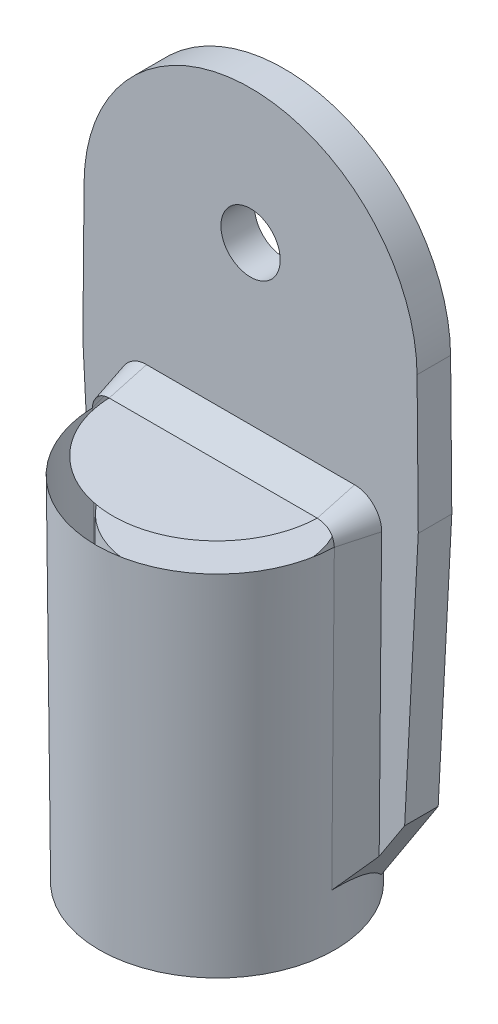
ISO-10303-21;
HEADER;
FILE_DESCRIPTION(('STEP AP214'),'2;1');
FILE_NAME('part.step','',(''),(''),'','','');
FILE_SCHEMA(('AUTOMOTIVE_DESIGN { 1 0 10303 214 1 1 1 1 }'));
ENDSEC;
DATA;
#1=APPLICATION_CONTEXT('core data for automotive mechanical design processes');
#2=APPLICATION_PROTOCOL_DEFINITION('international standard','automotive_design',2000,#1);
#3=PRODUCT_CONTEXT('',#1,'mechanical');
#4=PRODUCT('Part','Part','',(#3));
#5=PRODUCT_RELATED_PRODUCT_CATEGORY('part','',(#4));
#6=PRODUCT_DEFINITION_FORMATION('','',#4);
#7=PRODUCT_DEFINITION_CONTEXT('part definition',#1,'design');
#8=PRODUCT_DEFINITION('design','',#6,#7);
#9=PRODUCT_DEFINITION_SHAPE('','',#8);
#10=(LENGTH_UNIT() NAMED_UNIT(*) SI_UNIT(.MILLI.,.METRE.));
#11=(NAMED_UNIT(*) PLANE_ANGLE_UNIT() SI_UNIT($,.RADIAN.));
#12=(NAMED_UNIT(*) SI_UNIT($,.STERADIAN.) SOLID_ANGLE_UNIT());
#13=UNCERTAINTY_MEASURE_WITH_UNIT(LENGTH_MEASURE(1.E-05),#10,'distance_accuracy_value','');
#14=(GEOMETRIC_REPRESENTATION_CONTEXT(3) GLOBAL_UNCERTAINTY_ASSIGNED_CONTEXT((#13)) GLOBAL_UNIT_ASSIGNED_CONTEXT((#10,
#11,#12)) REPRESENTATION_CONTEXT('',''));
#15=CARTESIAN_POINT('',(0.,0.,0.));
#16=DIRECTION('',(0.,0.,1.));
#17=DIRECTION('',(1.,0.,0.));
#18=AXIS2_PLACEMENT_3D('',#15,#16,#17);
#19=CARTESIAN_POINT('',(12.6095898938,12.899972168,-2.54));
#20=DIRECTION('',(0.999961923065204,0.00872653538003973,0.));
#21=DIRECTION('',(0.00872653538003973,-0.999961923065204,0.));
#22=AXIS2_PLACEMENT_3D('',#19,#20,#21);
#23=PLANE('',#22);
#24=DIRECTION('',(0.,0.,1.));
#25=VECTOR('',#24,1.);
#26=CARTESIAN_POINT('',(12.7,2.54,-3.81));
#27=LINE('',#26,#25);
#28=CARTESIAN_POINT('',(12.6999999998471,2.53999991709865,-5.08));
#29=VERTEX_POINT('',#28);
#30=CARTESIAN_POINT('',(12.6999999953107,2.54000000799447,-2.54));
#31=VERTEX_POINT('',#30);
#32=EDGE_CURVE('E357',#29,#31,#27,.T.);
#33=ORIENTED_EDGE('',*,*,#32,.F.);
#34=DIRECTION('',(0.00872653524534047,-0.999961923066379,0.));
#35=VECTOR('',#34,1.);
#36=CARTESIAN_POINT('',(12.60958988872,12.8999721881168,-5.08));
#37=LINE('',#36,#35);
#38=CARTESIAN_POINT('',(12.6095898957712,12.8999721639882,-5.08));
#39=VERTEX_POINT('',#38);
#40=EDGE_CURVE('E360',#39,#29,#37,.T.);
#41=ORIENTED_EDGE('',*,*,#40,.F.);
#42=DIRECTION('',(0.,0.,-1.));
#43=VECTOR('',#42,1.);
#44=CARTESIAN_POINT('',(12.6095899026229,12.899972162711,-3.81));
#45=LINE('',#44,#43);
#46=CARTESIAN_POINT('',(12.6095898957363,12.8999721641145,-2.54));
#47=VERTEX_POINT('',#46);
#48=EDGE_CURVE('E359',#39,#47,#45,.F.);
#49=ORIENTED_EDGE('',*,*,#48,.T.);
#50=DIRECTION('',(-0.00872653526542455,0.999961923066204,0.));
#51=VECTOR('',#50,1.);
#52=CARTESIAN_POINT('',(12.6999999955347,2.53999980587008,-2.54));
#53=LINE('',#52,#51);
#54=EDGE_CURVE('E341',#31,#47,#53,.T.);
#55=ORIENTED_EDGE('',*,*,#54,.F.);
#56=EDGE_LOOP('',(#33,#41,#49,#55));
#57=FACE_BOUND('',#56,.T.);
#58=ADVANCED_FACE('F19',(#57),#23,.T.);
#59=CARTESIAN_POINT('',(0.,12.7899299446,-2.54));
#60=DIRECTION('',(0.,0.,-1.));
#61=DIRECTION('',(-1.,0.,0.));
#62=AXIS2_PLACEMENT_3D('',#59,#60,#61);
#63=CYLINDRICAL_SURFACE('',#62,12.6100700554);
#64=CARTESIAN_POINT('',(0.,12.7899299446,-2.54));
#65=DIRECTION('',(0.,0.,-1.));
#66=DIRECTION('',(-1.,0.,0.));
#67=AXIS2_PLACEMENT_3D('',#64,#65,#66);
#68=CIRCLE('',#67,12.6100700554);
#69=CARTESIAN_POINT('',(-12.6095898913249,12.899972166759,-2.54));
#70=VERTEX_POINT('',#69);
#71=EDGE_CURVE('E339',#47,#70,#68,.F.);
#72=ORIENTED_EDGE('',*,*,#71,.F.);
#73=ORIENTED_EDGE('',*,*,#48,.F.);
#74=CARTESIAN_POINT('',(0.,12.7899299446,-5.08));
#75=DIRECTION('',(0.,0.,-1.));
#76=DIRECTION('',(-1.,0.,0.));
#77=AXIS2_PLACEMENT_3D('',#74,#75,#76);
#78=CIRCLE('',#77,12.6100700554);
#79=CARTESIAN_POINT('',(-12.6095898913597,12.8999721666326,-5.08));
#80=VERTEX_POINT('',#79);
#81=EDGE_CURVE('E543',#80,#39,#78,.T.);
#82=ORIENTED_EDGE('',*,*,#81,.F.);
#83=DIRECTION('',(0.,0.,-1.));
#84=VECTOR('',#83,1.);
#85=CARTESIAN_POINT('',(-12.6095898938,12.899972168,-3.81));
#86=LINE('',#85,#84);
#87=EDGE_CURVE('E365',#70,#80,#86,.T.);
#88=ORIENTED_EDGE('',*,*,#87,.F.);
#89=EDGE_LOOP('',(#72,#73,#82,#88));
#90=FACE_BOUND('',#89,.T.);
#91=ADVANCED_FACE('F713',(#90),#63,.T.);
#92=CARTESIAN_POINT('',(-12.7,2.54,-2.54));
#93=DIRECTION('',(-0.999961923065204,0.00872653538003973,0.));
#94=DIRECTION('',(0.00872653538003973,0.999961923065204,0.));
#95=AXIS2_PLACEMENT_3D('',#92,#93,#94);
#96=PLANE('',#95);
#97=ORIENTED_EDGE('',*,*,#87,.T.);
#98=DIRECTION('',(0.00872653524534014,0.999961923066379,0.));
#99=VECTOR('',#98,1.);
#100=CARTESIAN_POINT('',(-12.6999999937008,2.5399999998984,-5.08));
#101=LINE('',#100,#99);
#102=CARTESIAN_POINT('',(-12.6999999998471,2.53999991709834,-5.08));
#103=VERTEX_POINT('',#102);
#104=EDGE_CURVE('E23',#103,#80,#101,.T.);
#105=ORIENTED_EDGE('',*,*,#104,.F.);
#106=DIRECTION('',(0.,0.,-1.));
#107=VECTOR('',#106,1.);
#108=CARTESIAN_POINT('',(-12.7,2.54,-3.81));
#109=LINE('',#108,#107);
#110=CARTESIAN_POINT('',(-12.6999999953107,2.54000000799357,-2.54));
#111=VERTEX_POINT('',#110);
#112=EDGE_CURVE('E130',#111,#103,#109,.T.);
#113=ORIENTED_EDGE('',*,*,#112,.F.);
#114=DIRECTION('',(-0.00872653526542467,-0.999961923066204,0.));
#115=VECTOR('',#114,1.);
#116=CARTESIAN_POINT('',(-12.60958988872,12.8999721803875,-2.54));
#117=LINE('',#116,#115);
#118=EDGE_CURVE('E336',#70,#111,#117,.T.);
#119=ORIENTED_EDGE('',*,*,#118,.F.);
#120=EDGE_LOOP('',(#97,#105,#113,#119));
#121=FACE_BOUND('',#120,.T.);
#122=ADVANCED_FACE('F567',(#121),#96,.T.);
#123=CARTESIAN_POINT('',(-7.8796909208,3.3144586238,-2.54));
#124=DIRECTION('',(0.,0.964540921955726,0.263933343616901));
#125=DIRECTION('',(0.,-0.263933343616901,0.964540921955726));
#126=AXIS2_PLACEMENT_3D('',#123,#124,#125);
#127=PLANE('',#126);
#128=DIRECTION('',(0.,-0.263933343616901,0.964540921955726));
#129=VECTOR('',#128,1.);
#130=CARTESIAN_POINT('',(7.8796909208,2.9272293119,-1.1248755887));
#131=LINE('',#130,#129);
#132=CARTESIAN_POINT('',(7.879690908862,3.31445863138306,-2.54));
#133=VERTEX_POINT('',#132);
#134=CARTESIAN_POINT('',(7.87981625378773,2.53999999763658,0.286804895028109));
#135=VERTEX_POINT('',#134);
#136=EDGE_CURVE('E220',#133,#135,#131,.T.);
#137=ORIENTED_EDGE('',*,*,#136,.F.);
#138=DIRECTION('',(1.,0.,0.));
#139=VECTOR('',#138,1.);
#140=CARTESIAN_POINT('',(0.,3.31445863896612,-2.54));
#141=LINE('',#140,#139);
#142=CARTESIAN_POINT('',(-7.87969101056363,3.3144586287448,-2.54000000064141));
#143=VERTEX_POINT('',#142);
#144=EDGE_CURVE('E215',#143,#133,#141,.T.);
#145=ORIENTED_EDGE('',*,*,#144,.F.);
#146=DIRECTION('',(-2.61728994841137E-08,0.263933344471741,-0.964540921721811));
#147=VECTOR('',#146,1.);
#148=CARTESIAN_POINT('',(-7.87969108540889,2.92722931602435,-1.12487559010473));
#149=LINE('',#148,#147);
#150=CARTESIAN_POINT('',(-7.87969093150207,2.53999999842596,0.290248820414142));
#151=VERTEX_POINT('',#150);
#152=EDGE_CURVE('E196',#151,#143,#149,.T.);
#153=ORIENTED_EDGE('',*,*,#152,.F.);
#154=DIRECTION('',(-1.,0.,0.));
#155=VECTOR('',#154,1.);
#156=CARTESIAN_POINT('',(0.000125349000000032,2.54,0.290248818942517));
#157=LINE('',#156,#155);
#158=EDGE_CURVE('E188',#151,#135,#157,.F.);
#159=ORIENTED_EDGE('',*,*,#158,.T.);
#160=EDGE_LOOP('',(#137,#145,#153,#159));
#161=FACE_BOUND('',#160,.T.);
#162=ADVANCED_FACE('F213',(#161),#127,.T.);
#163=CARTESIAN_POINT('',(0.,15.24,-5.08));
#164=DIRECTION('',(0.,0.,1.));
#165=DIRECTION('',(1.,0.,0.));
#166=AXIS2_PLACEMENT_3D('',#163,#164,#165);
#167=CYLINDRICAL_SURFACE('',#166,2.2479);
#168=CARTESIAN_POINT('',(0.,15.24,-2.54));
#169=DIRECTION('',(0.,0.,1.));
#170=DIRECTION('',(1.,0.,0.));
#171=AXIS2_PLACEMENT_3D('',#168,#169,#170);
#172=CIRCLE('',#171,2.2479);
#173=CARTESIAN_POINT('',(2.2479,15.24,-2.54));
#174=VERTEX_POINT('',#173);
#175=EDGE_CURVE('E332',#174,#174,#172,.F.);
#176=ORIENTED_EDGE('',*,*,#175,.F.);
#177=EDGE_LOOP('',(#176));
#178=FACE_BOUND('',#177,.T.);
#179=CARTESIAN_POINT('',(0.,15.24,-5.08));
#180=DIRECTION('',(0.,0.,1.));
#181=DIRECTION('',(1.,0.,0.));
#182=AXIS2_PLACEMENT_3D('',#179,#180,#181);
#183=CIRCLE('',#182,2.2479);
#184=CARTESIAN_POINT('',(2.2479,15.24,-5.08));
#185=VERTEX_POINT('',#184);
#186=EDGE_CURVE('E311',#185,#185,#183,.T.);
#187=ORIENTED_EDGE('',*,*,#186,.F.);
#188=EDGE_LOOP('',(#187));
#189=FACE_BOUND('',#188,.T.);
#190=ADVANCED_FACE('F560',(#178,#189),#167,.F.);
#191=CARTESIAN_POINT('',(12.7,2.54,-2.54));
#192=DIRECTION('',(0.99862953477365,-0.0523359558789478,0.));
#193=DIRECTION('',(-0.0523359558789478,-0.99862953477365,0.));
#194=AXIS2_PLACEMENT_3D('',#191,#192,#193);
#195=PLANE('',#194);
#196=DIRECTION('',(-0.0523359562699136,-0.99862953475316,0.));
#197=VECTOR('',#196,1.);
#198=CARTESIAN_POINT('',(12.7000000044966,2.54000000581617,-5.08));
#199=LINE('',#198,#197);
#200=CARTESIAN_POINT('',(11.6678511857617,-17.1545727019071,-5.08));
#201=VERTEX_POINT('',#200);
#202=EDGE_CURVE('E416',#29,#201,#199,.T.);
#203=ORIENTED_EDGE('',*,*,#202,.F.);
#204=ORIENTED_EDGE('',*,*,#32,.T.);
#205=DIRECTION('',(0.0523359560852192,0.99862953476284,0.));
#206=VECTOR('',#205,1.);
#207=CARTESIAN_POINT('',(11.6678511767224,-17.1545727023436,-2.54));
#208=LINE('',#207,#206);
#209=CARTESIAN_POINT('',(11.6678511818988,-17.154572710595,-2.5400000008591));
#210=VERTEX_POINT('',#209);
#211=EDGE_CURVE('E309',#210,#31,#208,.T.);
#212=ORIENTED_EDGE('',*,*,#211,.F.);
#213=DIRECTION('',(0.,0.,-1.));
#214=VECTOR('',#213,1.);
#215=CARTESIAN_POINT('',(11.667851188,-17.1545727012,-2.390382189));
#216=LINE('',#215,#214);
#217=EDGE_CURVE('E425',#210,#201,#216,.T.);
#218=ORIENTED_EDGE('',*,*,#217,.T.);
#219=EDGE_LOOP('',(#203,#204,#212,#218));
#220=FACE_BOUND('',#219,.T.);
#221=ADVANCED_FACE('F390',(#220),#195,.T.);
#222=CARTESIAN_POINT('',(-6.1029031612,2.54,-5.08));
#223=DIRECTION('',(0.,1.,0.));
#224=DIRECTION('',(1.,0.,0.));
#225=AXIS2_PLACEMENT_3D('',#222,#223,#224);
#226=PLANE('',#225);
#227=DIRECTION('',(-1.,0.,0.));
#228=VECTOR('',#227,1.);
#229=CARTESIAN_POINT('',(0.,2.5399999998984,-5.08));
#230=LINE('',#229,#228);
#231=CARTESIAN_POINT('',(6.03053672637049,2.53999999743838,-5.07999999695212));
#232=VERTEX_POINT('',#231);
#233=CARTESIAN_POINT('',(-6.03053672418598,2.53999999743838,-5.08000000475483));
#234=VERTEX_POINT('',#233);
#235=EDGE_CURVE('E518',#232,#234,#230,.T.);
#236=ORIENTED_EDGE('',*,*,#235,.F.);
#237=CARTESIAN_POINT('',(-6.61090408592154,2.53999999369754,-4.29764125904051));
#238=CARTESIAN_POINT('',(-3.16299721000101,2.53999999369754,-9.60143009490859));
#239=CARTESIAN_POINT('',(3.16299979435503,2.53999999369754,-9.60142924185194));
#240=CARTESIAN_POINT('',(6.6109052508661,2.53999999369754,-4.29763945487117));
#241=(BOUNDED_CURVE() B_SPLINE_CURVE(3,(#237,#238,#239,#240),.UNSPECIFIED.,.F.,
.F.) B_SPLINE_CURVE_WITH_KNOTS((4,4),(0.,1.),
.UNSPECIFIED.) CURVE() GEOMETRIC_REPRESENTATION_ITEM() RATIONAL_B_SPLINE_CURVE((0.956328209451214,
0.666265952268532,0.666265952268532,0.956328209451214)) REPRESENTATION_ITEM(''));
#242=EDGE_CURVE('E142',#234,#232,#241,.T.);
#243=ORIENTED_EDGE('',*,*,#242,.F.);
#244=EDGE_LOOP('',(#236,#243));
#245=FACE_BOUND('',#244,.T.);
#246=ADVANCED_FACE('F379',(#245),#226,.T.);
#247=CARTESIAN_POINT('',(-11.667851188,-17.1545727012,-2.54));
#248=DIRECTION('',(-0.99862953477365,-0.0523359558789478,0.));
#249=DIRECTION('',(-0.0523359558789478,0.99862953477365,0.));
#250=AXIS2_PLACEMENT_3D('',#247,#248,#249);
#251=PLANE('',#250);
#252=DIRECTION('',(0.0523359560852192,-0.99862953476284,0.));
#253=VECTOR('',#252,1.);
#254=CARTESIAN_POINT('',(-12.6999999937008,2.54000001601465,-2.54));
#255=LINE('',#254,#253);
#256=CARTESIAN_POINT('',(-11.6678511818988,-17.154572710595,-2.5400000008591));
#257=VERTEX_POINT('',#256);
#258=EDGE_CURVE('E331',#111,#257,#255,.T.);
#259=ORIENTED_EDGE('',*,*,#258,.F.);
#260=ORIENTED_EDGE('',*,*,#112,.T.);
#261=DIRECTION('',(-0.0523359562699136,0.99862953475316,0.));
#262=VECTOR('',#261,1.);
#263=CARTESIAN_POINT('',(-11.6678511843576,-17.154572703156,-5.08));
#264=LINE('',#263,#262);
#265=CARTESIAN_POINT('',(-11.6678511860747,-17.1545727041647,-5.08));
#266=VERTEX_POINT('',#265);
#267=EDGE_CURVE('E516',#266,#103,#264,.T.);
#268=ORIENTED_EDGE('',*,*,#267,.F.);
#269=DIRECTION('',(0.,0.,1.));
#270=VECTOR('',#269,1.);
#271=CARTESIAN_POINT('',(-11.667851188,-17.1545727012,-2.390382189));
#272=LINE('',#271,#270);
#273=EDGE_CURVE('E449',#266,#257,#272,.T.);
#274=ORIENTED_EDGE('',*,*,#273,.T.);
#275=EDGE_LOOP('',(#259,#260,#268,#274));
#276=FACE_BOUND('',#275,.T.);
#277=ADVANCED_FACE('F389',(#276),#251,.T.);
#278=CARTESIAN_POINT('',(-7.9742486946,2.54,7.930644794));
#279=DIRECTION('',(0.,1.,0.));
#280=DIRECTION('',(1.,0.,0.));
#281=AXIS2_PLACEMENT_3D('',#278,#279,#280);
#282=PLANE('',#281);
#283=CARTESIAN_POINT('',(7.88458564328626,2.53999999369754,0.0841565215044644));
#284=CARTESIAN_POINT('',(7.71979966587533,2.53999999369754,15.5228781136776));
#285=CARTESIAN_POINT('',(-7.71980131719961,2.53999999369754,15.5228772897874));
#286=CARTESIAN_POINT('',(-7.88458566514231,2.53999999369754,0.0841556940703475));
#287=(BOUNDED_CURVE() B_SPLINE_CURVE(3,(#283,#284,#285,#286),.UNSPECIFIED.,.F.,
.F.) B_SPLINE_CURVE_WITH_KNOTS((4,4),(0.,1.),
.UNSPECIFIED.) CURVE() GEOMETRIC_REPRESENTATION_ITEM() RATIONAL_B_SPLINE_CURVE((0.956328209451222,
0.325580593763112,0.325580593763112,0.956328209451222)) REPRESENTATION_ITEM(''));
#288=EDGE_CURVE('E191',#135,#151,#287,.T.);
#289=ORIENTED_EDGE('',*,*,#288,.F.);
#290=ORIENTED_EDGE('',*,*,#158,.F.);
#291=EDGE_LOOP('',(#289,#290));
#292=FACE_BOUND('',#291,.T.);
#293=ADVANCED_FACE('F190',(#292),#282,.T.);
#294=CARTESIAN_POINT('',(-9.9251724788,1.2521589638,-2.54));
#295=CARTESIAN_POINT('',(-9.9621071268,2.355642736,-2.54));
#296=CARTESIAN_POINT('',(-8.9780306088,3.3419866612,-2.54));
#297=CARTESIAN_POINT('',(-7.8796909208,3.3144586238,-2.54));
#298=CARTESIAN_POINT('',(-9.1510742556,1.2589172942,0.2676113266));
#299=CARTESIAN_POINT('',(-9.1740156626,1.9443918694,0.2674700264));
#300=CARTESIAN_POINT('',(-8.562523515,2.557100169,0.2750487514));
#301=CARTESIAN_POINT('',(-7.8796909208,2.54,0.2902488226));
#302=CARTESIAN_POINT('',(-9.14126049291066,1.25900297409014,0.303205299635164));
#303=CARTESIAN_POINT('',(-9.16402449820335,1.93917816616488,0.303062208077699));
#304=CARTESIAN_POINT('',(-8.55725585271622,2.54714963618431,0.310737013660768));
#305=CARTESIAN_POINT('',(-7.8796909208,2.53018166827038,0.326129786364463));
#306=B_SPLINE_SURFACE_WITH_KNOTS('',1,3,((#294,#295,#296,#297),(#298,#299,#300,#301),(#302,#303,
#304,#305)),.UNSPECIFIED.,.F.,.F.,.F.,(2,1,2),(4,4),(0.,1.,1.01267767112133),(0.,
0.00321247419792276),.UNSPECIFIED.);
#307=CARTESIAN_POINT('',(-9.92517248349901,1.25215910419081,-2.54));
#308=CARTESIAN_POINT('',(-9.92682129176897,1.30128076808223,-2.54));
#309=CARTESIAN_POINT('',(-9.92644564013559,1.35044730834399,-2.54));
#310=CARTESIAN_POINT('',(-9.92171191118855,1.44856797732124,-2.54));
#311=CARTESIAN_POINT('',(-9.91735553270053,1.49752218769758,-2.54));
#312=CARTESIAN_POINT('',(-9.89846766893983,1.64326581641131,-2.54));
#313=CARTESIAN_POINT('',(-9.87813009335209,1.73935489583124,-2.54));
#314=CARTESIAN_POINT('',(-9.82151359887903,1.93265896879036,-2.54));
#315=CARTESIAN_POINT('',(-9.78438578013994,2.02962136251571,-2.54));
#316=CARTESIAN_POINT('',(-9.69575172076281,2.21682989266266,-2.54));
#317=CARTESIAN_POINT('',(-9.64422831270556,2.30706784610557,-2.54));
#318=CARTESIAN_POINT('',(-9.52308960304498,2.48711692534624,-2.54));
#319=CARTESIAN_POINT('',(-9.45222883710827,2.57609040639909,-2.54));
#320=CARTESIAN_POINT('',(-9.29742540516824,2.7418923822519,-2.54));
#321=CARTESIAN_POINT('',(-9.21347472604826,2.81871337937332,-2.54));
#322=CARTESIAN_POINT('',(-9.02848853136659,2.9628284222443,-2.54));
#323=CARTESIAN_POINT('',(-8.92668583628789,3.02914151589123,-2.54));
#324=CARTESIAN_POINT('',(-8.71304466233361,3.14283846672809,-2.54));
#325=CARTESIAN_POINT('',(-8.60122226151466,3.19025200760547,-2.54));
#326=CARTESIAN_POINT('',(-8.43728722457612,3.24234221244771,-2.54));
#327=CARTESIAN_POINT('',(-8.38787738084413,3.25590539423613,-2.54));
#328=CARTESIAN_POINT('',(-8.28811425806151,3.27897544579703,-2.54));
#329=CARTESIAN_POINT('',(-8.23776119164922,3.28848321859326,-2.54));
#330=CARTESIAN_POINT('',(-8.13626299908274,3.3032988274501,-2.54));
#331=CARTESIAN_POINT('',(-8.08511573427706,3.30859200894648,-2.54));
#332=CARTESIAN_POINT('',(-7.9825270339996,3.314822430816,-2.54));
#333=CARTESIAN_POINT('',(-7.93108544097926,3.31575706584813,-2.54));
#334=CARTESIAN_POINT('',(-7.87969095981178,3.31445862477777,-2.54));
#335=B_SPLINE_CURVE_WITH_KNOTS('',3,(#307,#308,#309,#310,#311,#312,#313,#314,#315,#316,#317,
#318,#319,#320,#321,#322,#323,#324,#325,#326,#327,#328,#329,#330,#331,#332,#333,#334),
.UNSPECIFIED.,.F.,.F.,(4,2,2,2,2,2,2,2,2,2,2,2,2,4),(0.,0.147363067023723,0.29466327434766,
0.588021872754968,0.898238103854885,1.20882587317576,1.54861211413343,1.88860718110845,
2.25134411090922,2.61350905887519,2.76708991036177,2.92063654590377,3.07471477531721,
3.22888509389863),.UNSPECIFIED.);
#336=CARTESIAN_POINT('',(-9.92517282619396,1.25215919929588,-2.54000008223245));
#337=VERTEX_POINT('',#336);
#338=EDGE_CURVE('E324',#337,#143,#335,.T.);
#339=DIRECTION('',(-0.265795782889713,-0.00232055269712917,-0.964026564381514));
#340=VECTOR('',#339,1.);
#341=CARTESIAN_POINT('',(-9.53808466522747,1.25553880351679,-1.13605395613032));
#342=LINE('',#341,#340);
#343=CARTESIAN_POINT('',(-9.15102349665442,1.25891732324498,0.269332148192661));
#344=VERTEX_POINT('',#343);
#345=EDGE_CURVE('E223',#344,#337,#342,.T.);
#346=CARTESIAN_POINT('',(-7.87969092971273,2.53999999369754,0.290248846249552));
#347=CARTESIAN_POINT('',(-7.91413910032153,2.54000542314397,0.292654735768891));
#348=CARTESIAN_POINT('',(-7.94862865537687,2.53859325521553,0.294334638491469));
#349=CARTESIAN_POINT('',(-8.01739205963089,2.53296792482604,0.29641998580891));
#350=CARTESIAN_POINT('',(-8.05166605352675,2.52875690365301,0.296826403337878));
#351=CARTESIAN_POINT('',(-8.11967298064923,2.51758118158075,0.296545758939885));
#352=CARTESIAN_POINT('',(-8.15340700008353,2.51062300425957,0.295861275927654));
#353=CARTESIAN_POINT('',(-8.22017531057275,2.49401752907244,0.293685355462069));
#354=CARTESIAN_POINT('',(-8.25320947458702,2.48436974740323,0.292193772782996));
#355=CARTESIAN_POINT('',(-8.35080322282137,2.45153343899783,0.286986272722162));
#356=CARTESIAN_POINT('',(-8.41404938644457,2.42441954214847,0.282533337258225));
#357=CARTESIAN_POINT('',(-8.53536785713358,2.36037496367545,0.274100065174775));
#358=CARTESIAN_POINT('',(-8.59343940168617,2.32344283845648,0.270119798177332));
#359=CARTESIAN_POINT('',(-8.70534468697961,2.23877009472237,0.264233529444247));
#360=CARTESIAN_POINT('',(-8.75888084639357,2.1906264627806,0.26242616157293));
#361=CARTESIAN_POINT('',(-8.85702432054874,2.08593354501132,0.261800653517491));
#362=CARTESIAN_POINT('',(-8.9016298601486,2.02938259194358,0.262983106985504));
#363=CARTESIAN_POINT('',(-8.97935866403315,1.91146696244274,0.26725671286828));
#364=CARTESIAN_POINT('',(-9.01279219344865,1.85030317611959,0.2702881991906));
#365=CARTESIAN_POINT('',(-9.06920473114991,1.72331870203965,0.276009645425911));
#366=CARTESIAN_POINT('',(-9.0921917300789,1.65750161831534,0.278699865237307));
#367=CARTESIAN_POINT('',(-9.11671632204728,1.56328844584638,0.280228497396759));
#368=CARTESIAN_POINT('',(-9.12286056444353,1.53605004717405,0.280408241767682));
#369=CARTESIAN_POINT('',(-9.13336179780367,1.48123359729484,0.280076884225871));
#370=CARTESIAN_POINT('',(-9.13771918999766,1.45365562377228,0.279565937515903));
#371=CARTESIAN_POINT('',(-9.14463364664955,1.39826783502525,0.277701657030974));
#372=CARTESIAN_POINT('',(-9.14718841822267,1.3704577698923,0.276347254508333));
#373=CARTESIAN_POINT('',(-9.15048967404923,1.31477676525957,0.272707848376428));
#374=CARTESIAN_POINT('',(-9.15123519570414,1.28690580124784,0.270422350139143));
#375=CARTESIAN_POINT('',(-9.15107523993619,1.25908746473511,0.267628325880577));
#376=B_SPLINE_CURVE_WITH_KNOTS('',3,(#346,#347,#348,#349,#350,#351,#352,#353,#354,#355,#356,
#357,#358,#359,#360,#361,#362,#363,#364,#365,#366,#367,#368,#369,#370,#371,#372,#373,#374,#375),
.UNSPECIFIED.,.F.,.F.,(4,2,2,2,2,2,2,2,2,2,2,2,2,2,4),(0.,0.103545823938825,0.207012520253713,
0.310234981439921,0.413476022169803,0.619371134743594,0.825296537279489,1.04025380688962,
1.25525376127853,1.46365814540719,1.67190284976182,1.75562230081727,1.83932294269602,
1.92312985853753,2.00698135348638),.UNSPECIFIED.);
#377=EDGE_CURVE('E205',#151,#344,#376,.T.);
#378=ORIENTED_EDGE('',*,*,#152,.T.);
#379=ORIENTED_EDGE('',*,*,#338,.F.);
#380=ORIENTED_EDGE('',*,*,#345,.F.);
#381=ORIENTED_EDGE('',*,*,#377,.F.);
#382=EDGE_LOOP('',(#378,#379,#380,#381));
#383=FACE_BOUND('',#382,.T.);
#384=ADVANCED_FACE('F222',(#383),#306,.T.);
#385=CARTESIAN_POINT('',(7.84625571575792,3.31362710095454,-2.54));
#386=CARTESIAN_POINT('',(7.85740078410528,3.31390427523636,-2.54));
#387=CARTESIAN_POINT('',(7.86854585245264,3.31418144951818,-2.54));
#388=CARTESIAN_POINT('',(7.8796909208,3.3144586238,-2.54));
#389=CARTESIAN_POINT('',(8.9831630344,3.341901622,-2.54));
#390=CARTESIAN_POINT('',(9.9621834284,2.3504675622,-2.54));
#391=CARTESIAN_POINT('',(9.9251724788,1.2521589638,-2.54));
#392=CARTESIAN_POINT('',(9.924802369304,1.241175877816,-2.54));
#393=CARTESIAN_POINT('',(9.924432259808,1.230192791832,-2.54));
#394=CARTESIAN_POINT('',(9.924062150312,1.219209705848,-2.54));
#395=CARTESIAN_POINT('',(7.85890442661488,2.5394834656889,0.29071123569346));
#396=CARTESIAN_POINT('',(7.86583325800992,2.5396556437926,0.29055709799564));
#397=CARTESIAN_POINT('',(7.87276208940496,2.5398278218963,0.29040296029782));
#398=CARTESIAN_POINT('',(7.8796909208,2.54,0.2902488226));
#399=CARTESIAN_POINT('',(8.5657138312,2.557047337,0.2749876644));
#400=CARTESIAN_POINT('',(9.1740627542,1.941177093,0.2674764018));
#401=CARTESIAN_POINT('',(9.1510742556,1.2589172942,0.2676113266));
#402=CARTESIAN_POINT('',(9.150844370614,1.252094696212,0.267612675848));
#403=CARTESIAN_POINT('',(9.150614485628,1.245272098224,0.267614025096));
#404=CARTESIAN_POINT('',(9.150384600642,1.238449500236,0.267615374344));
#405=CARTESIAN_POINT('',(7.85907459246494,2.52906874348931,0.32879340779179));
#406=CARTESIAN_POINT('',(7.86594670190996,2.52923950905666,0.328637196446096));
#407=CARTESIAN_POINT('',(7.87281881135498,2.529410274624,0.328480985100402));
#408=CARTESIAN_POINT('',(7.8796909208,2.52958104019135,0.328324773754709));
#409=CARTESIAN_POINT('',(8.56009779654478,2.54648852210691,0.312858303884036));
#410=CARTESIAN_POINT('',(9.16345999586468,1.93567081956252,0.305245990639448));
#411=CARTESIAN_POINT('',(9.14066014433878,1.25900821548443,0.305382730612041));
#412=CARTESIAN_POINT('',(9.14043214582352,1.25224158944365,0.305384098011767));
#413=CARTESIAN_POINT('',(9.14020414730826,1.24547496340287,0.305385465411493));
#414=CARTESIAN_POINT('',(9.139976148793,1.23870833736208,0.305386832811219));
#415=B_SPLINE_SURFACE_WITH_KNOTS('',1,3,((#385,#386,#387,#388,#389,#390,#391,#392,#393,#394),
(#395,#396,#397,#398,#399,#400,#401,#402,#403,#404),(#405,#406,#407,#408,#409,#410,#411,#412,
#413,#414)),.UNSPECIFIED.,.F.,.F.,.F.,(2,1,2),(4,3,3,4),(0.,1.,1.0134532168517),
(-3.24459861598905E-05,0.,0.00321247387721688,0.00324459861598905),.UNSPECIFIED.);
#416=DIRECTION('',(-0.265795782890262,0.00232055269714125,0.964026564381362));
#417=VECTOR('',#416,1.);
#418=CARTESIAN_POINT('',(9.534252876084,1.255571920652,-1.122156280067));
#419=LINE('',#418,#417);
#420=CARTESIAN_POINT('',(9.92517236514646,1.25215894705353,-2.5399999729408));
#421=VERTEX_POINT('',#420);
#422=CARTESIAN_POINT('',(9.15107439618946,1.25891729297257,0.267610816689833));
#423=VERTEX_POINT('',#422);
#424=EDGE_CURVE('E226',#421,#423,#419,.T.);
#425=CARTESIAN_POINT('',(7.87969090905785,3.31445862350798,-2.54));
#426=CARTESIAN_POINT('',(7.94093714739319,3.316002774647,-2.54));
#427=CARTESIAN_POINT('',(8.0022462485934,3.31437768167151,-2.54));
#428=CARTESIAN_POINT('',(8.12435108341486,3.30497856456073,-2.54));
#429=CARTESIAN_POINT('',(8.18514714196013,3.29720878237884,-2.54));
#430=CARTESIAN_POINT('',(8.30527263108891,3.27578285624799,-2.54));
#431=CARTESIAN_POINT('',(8.36460912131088,3.262166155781,-2.54));
#432=CARTESIAN_POINT('',(8.48170330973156,3.22935833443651,-2.54));
#433=CARTESIAN_POINT('',(8.53946096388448,3.21016705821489,-2.54));
#434=CARTESIAN_POINT('',(8.69381146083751,3.15082096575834,-2.54));
#435=CARTESIAN_POINT('',(8.78846863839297,3.10551446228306,-2.54));
#436=CARTESIAN_POINT('',(8.96990867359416,3.00114933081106,-2.54));
#437=CARTESIAN_POINT('',(9.05668238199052,2.94207500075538,-2.54));
#438=CARTESIAN_POINT('',(9.22950424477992,2.80491047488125,-2.54));
#439=CARTESIAN_POINT('',(9.31447746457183,2.7254606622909,-2.54));
#440=CARTESIAN_POINT('',(9.47065831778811,2.55394445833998,-2.54));
#441=CARTESIAN_POINT('',(9.54185765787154,2.46187052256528,-2.54));
#442=CARTESIAN_POINT('',(9.67102345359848,2.26294622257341,-2.54));
#443=CARTESIAN_POINT('',(9.72826503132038,2.15562231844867,-2.54));
#444=CARTESIAN_POINT('',(9.82237592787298,1.93249675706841,-2.54));
#445=CARTESIAN_POINT('',(9.85928658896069,1.81671285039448,-2.54));
#446=CARTESIAN_POINT('',(9.90052384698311,1.62533985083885,-2.54));
#447=CARTESIAN_POINT('',(9.91190490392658,1.55122154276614,-2.54));
#448=CARTESIAN_POINT('',(9.92551185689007,1.40209348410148,-2.54));
#449=CARTESIAN_POINT('',(9.92773020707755,1.32708304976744,-2.54));
#450=CARTESIAN_POINT('',(9.92517247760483,1.25215892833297,-2.54));
#451=B_SPLINE_CURVE_WITH_KNOTS('',3,(#425,#426,#427,#428,#429,#430,#431,#432,#433,#434,#435,
#436,#437,#438,#439,#440,#441,#442,#443,#444,#445,#446,#447,#448,#449,#450),.UNSPECIFIED.,.F.,
.F.,(4,2,2,2,2,2,2,2,2,2,2,2,4),(0.,0.183691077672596,0.367255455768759,0.549600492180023,
0.73195061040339,1.04540927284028,1.35922719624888,1.70668584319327,2.05435305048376,
2.41740293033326,2.77971180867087,3.00414939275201,3.22877177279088),.UNSPECIFIED.);
#452=EDGE_CURVE('E301',#133,#421,#451,.T.);
#453=CARTESIAN_POINT('',(9.15107427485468,1.25891727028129,0.267611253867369));
#454=CARTESIAN_POINT('',(9.15127892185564,1.29340130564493,0.27112029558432));
#455=CARTESIAN_POINT('',(9.15008902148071,1.32796711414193,0.273801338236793));
#456=CARTESIAN_POINT('',(9.14492941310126,1.39694428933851,0.277727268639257));
#457=CARTESIAN_POINT('',(9.14096207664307,1.43135576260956,0.278973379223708));
#458=CARTESIAN_POINT('',(9.1302686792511,1.49969276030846,0.28025314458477));
#459=CARTESIAN_POINT('',(9.12354854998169,1.5336191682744,0.280289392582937));
#460=CARTESIAN_POINT('',(9.10739437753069,1.60080485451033,0.279496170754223));
#461=CARTESIAN_POINT('',(9.0979597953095,1.63406399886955,0.278666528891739));
#462=CARTESIAN_POINT('',(9.06569963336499,1.7323610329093,0.275436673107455));
#463=CARTESIAN_POINT('',(9.03888689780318,1.79611431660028,0.272295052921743));
#464=CARTESIAN_POINT('',(8.97525680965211,1.91840012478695,0.266697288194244));
#465=CARTESIAN_POINT('',(8.93844125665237,1.97693358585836,0.264241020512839));
#466=CARTESIAN_POINT('',(8.85437302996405,2.08904589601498,0.261657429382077));
#467=CARTESIAN_POINT('',(8.80682228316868,2.14240433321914,0.261607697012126));
#468=CARTESIAN_POINT('',(8.7034492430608,2.2403495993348,0.264413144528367));
#469=CARTESIAN_POINT('',(8.64762229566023,2.28493145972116,0.267269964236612));
#470=CARTESIAN_POINT('',(8.53072862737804,2.36319618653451,0.274660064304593));
#471=CARTESIAN_POINT('',(8.46980675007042,2.39710020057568,0.27915448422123));
#472=CARTESIAN_POINT('',(8.34328402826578,2.45454203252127,0.287664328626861));
#473=CARTESIAN_POINT('',(8.27768787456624,2.47809007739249,0.291680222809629));
#474=CARTESIAN_POINT('',(8.15670537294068,2.51066247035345,0.296158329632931));
#475=CARTESIAN_POINT('',(8.10186519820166,2.5216380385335,0.29716624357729));
#476=CARTESIAN_POINT('',(8.01888938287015,2.53264333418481,0.296390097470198));
#477=CARTESIAN_POINT('',(7.991085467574,2.53540210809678,0.295748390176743));
#478=CARTESIAN_POINT('',(7.93537443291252,2.53908270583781,0.293634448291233));
#479=CARTESIAN_POINT('',(7.90746726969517,2.54000362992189,0.29216180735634));
#480=CARTESIAN_POINT('',(7.87958170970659,2.53999998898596,0.290241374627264));
#481=B_SPLINE_CURVE_WITH_KNOTS('',3,(#453,#454,#455,#456,#457,#458,#459,#460,#461,#462,#463,
#464,#465,#466,#467,#468,#469,#470,#471,#472,#473,#474,#475,#476,#477,#478,#479,#480),
.UNSPECIFIED.,.F.,.F.,(4,2,2,2,2,2,2,2,2,2,2,2,2,4),(0.,0.103934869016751,0.207781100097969,
0.311404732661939,0.415048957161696,0.621750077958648,0.828414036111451,1.04173692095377,
1.25518022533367,1.46385727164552,1.67232777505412,1.83957296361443,1.92335069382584,
2.00716942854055),.UNSPECIFIED.);
#482=EDGE_CURVE('E208',#423,#135,#481,.T.);
#483=ORIENTED_EDGE('',*,*,#424,.F.);
#484=ORIENTED_EDGE('',*,*,#452,.F.);
#485=ORIENTED_EDGE('',*,*,#136,.T.);
#486=ORIENTED_EDGE('',*,*,#482,.F.);
#487=EDGE_LOOP('',(#483,#484,#485,#486));
#488=FACE_BOUND('',#487,.T.);
#489=ADVANCED_FACE('F283',(#488),#415,.T.);
#490=CARTESIAN_POINT('',(-12.8524,25.6731527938,-2.54));
#491=DIRECTION('',(0.,0.,1.));
#492=DIRECTION('',(0.,-1.,0.));
#493=AXIS2_PLACEMENT_3D('',#490,#491,#492);
#494=PLANE('',#493);
#495=ORIENTED_EDGE('',*,*,#175,.T.);
#496=EDGE_LOOP('',(#495));
#497=FACE_BOUND('',#496,.T.);
#498=ORIENTED_EDGE('',*,*,#338,.T.);
#499=ORIENTED_EDGE('',*,*,#144,.T.);
#500=ORIENTED_EDGE('',*,*,#452,.T.);
#501=DIRECTION('',(0.00873026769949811,0.99996189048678,0.));
#502=VECTOR('',#501,1.);
#503=CARTESIAN_POINT('',(9.825956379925,-10.111970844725,-2.54));
#504=LINE('',#503,#502);
#505=CARTESIAN_POINT('',(9.7385318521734,-20.1254643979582,-2.54000000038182));
#506=VERTEX_POINT('',#505);
#507=EDGE_CURVE('E434',#506,#421,#504,.T.);
#508=ORIENTED_EDGE('',*,*,#507,.F.);
#509=DIRECTION('',(0.544639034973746,0.838670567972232,0.));
#510=VECTOR('',#509,1.);
#511=CARTESIAN_POINT('',(9.4969467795,-20.49747234,-2.54000000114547));
#512=LINE('',#511,#510);
#513=EDGE_CURVE('E175',#506,#210,#512,.T.);
#514=ORIENTED_EDGE('',*,*,#513,.T.);
#515=ORIENTED_EDGE('',*,*,#211,.T.);
#516=ORIENTED_EDGE('',*,*,#54,.T.);
#517=ORIENTED_EDGE('',*,*,#71,.T.);
#518=ORIENTED_EDGE('',*,*,#118,.T.);
#519=ORIENTED_EDGE('',*,*,#258,.T.);
#520=DIRECTION('',(0.544639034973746,-0.838670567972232,0.));
#521=VECTOR('',#520,1.);
#522=CARTESIAN_POINT('',(-9.4969467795,-20.49747234,-2.54000000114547));
#523=LINE('',#522,#521);
#524=CARTESIAN_POINT('',(-9.73853134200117,-20.1254648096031,-2.54000000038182));
#525=VERTEX_POINT('',#524);
#526=EDGE_CURVE('E463',#257,#525,#523,.T.);
#527=ORIENTED_EDGE('',*,*,#526,.T.);
#528=DIRECTION('',(0.00873041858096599,-0.999961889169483,0.));
#529=VECTOR('',#528,1.);
#530=CARTESIAN_POINT('',(-9.82694854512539,-9.9983295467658,-2.54));
#531=LINE('',#530,#529);
#532=EDGE_CURVE('E744',#337,#525,#531,.T.);
#533=ORIENTED_EDGE('',*,*,#532,.F.);
#534=EDGE_LOOP('',(#498,#499,#500,#508,#514,#515,#516,#517,#518,#519,#527,#533));
#535=FACE_BOUND('',#534,.T.);
#536=ADVANCED_FACE('F288',(#497,#535),#494,.T.);
#537=CARTESIAN_POINT('',(7.326042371,-23.8403719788,0.299235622));
#538=DIRECTION('',(-0.838670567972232,0.544639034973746,0.));
#539=DIRECTION('',(0.544639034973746,0.838670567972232,0.));
#540=AXIS2_PLACEMENT_3D('',#537,#538,#539);
#541=PLANE('',#540);
#542=CARTESIAN_POINT('',(8.9538382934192,-21.3337856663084,0.267152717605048));
#543=CARTESIAN_POINT('',(8.9865338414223,-21.283438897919,0.150188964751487));
#544=CARTESIAN_POINT('',(9.01922936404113,-21.2330921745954,0.0332251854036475));
#545=CARTESIAN_POINT('',(9.08462041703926,-21.1323987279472,-0.200702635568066));
#546=CARTESIAN_POINT('',(9.11731594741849,-21.0820520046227,-0.317666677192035));
#547=CARTESIAN_POINT('',(9.18270701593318,-20.9813585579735,-0.551595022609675));
#548=CARTESIAN_POINT('',(9.21540255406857,-20.931011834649,-0.668559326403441));
#549=CARTESIAN_POINT('',(9.28079363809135,-20.8303183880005,-0.902488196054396));
#550=CARTESIAN_POINT('',(9.31348918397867,-20.7799716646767,-1.01945276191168));
#551=CARTESIAN_POINT('',(9.3788802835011,-20.6792782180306,-1.25338215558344));
#552=CARTESIAN_POINT('',(9.41157583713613,-20.6289314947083,-1.37034698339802));
#553=CARTESIAN_POINT('',(9.47696695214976,-20.528238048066,-1.60427690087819));
#554=CARTESIAN_POINT('',(9.50966251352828,-20.4778913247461,-1.72124199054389));
#555=CARTESIAN_POINT('',(9.5750536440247,-20.3771978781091,-1.95517243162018));
#556=CARTESIAN_POINT('',(9.60774921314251,-20.3268511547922,-2.07213778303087));
#557=CARTESIAN_POINT('',(9.67314035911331,-20.226157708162,-2.30606874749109));
#558=CARTESIAN_POINT('',(9.7058359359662,-20.1758109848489,-2.42303436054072));
#559=CARTESIAN_POINT('',(9.73853148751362,-20.1254643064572,-2.54));
#560=B_SPLINE_CURVE_WITH_KNOTS('',3,(#542,#543,#544,#545,#546,#547,#548,#549,#550,#551,#552,
#553,#554,#555,#556,#557,#558,#559),.UNSPECIFIED.,.F.,.F.,(4,2,2,2,2,2,2,2,4),(0.,
0.394409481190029,0.788819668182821,1.18323056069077,1.57764215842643,1.97205446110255,
2.36646746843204,2.76088118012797,3.15529559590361),.UNSPECIFIED.);
#561=CARTESIAN_POINT('',(8.95383878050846,-21.3337851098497,0.267150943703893));
#562=VERTEX_POINT('',#561);
#563=EDGE_CURVE('E232',#562,#506,#560,.T.);
#564=ORIENTED_EDGE('',*,*,#563,.F.);
#565=CARTESIAN_POINT('',(8.9538382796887,-21.3337860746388,0.267152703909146));
#566=CARTESIAN_POINT('',(8.9541748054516,-21.333267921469,0.256025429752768));
#567=CARTESIAN_POINT('',(8.95449034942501,-21.3327820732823,0.244896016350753));
#568=CARTESIAN_POINT('',(8.95507935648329,-21.3318751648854,0.222636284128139));
#569=CARTESIAN_POINT('',(8.95535283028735,-21.3314540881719,0.21150596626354));
#570=CARTESIAN_POINT('',(8.95585769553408,-21.3306767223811,0.189244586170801));
#571=CARTESIAN_POINT('',(8.95608909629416,-21.3303204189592,0.178113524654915));
#572=CARTESIAN_POINT('',(8.95650981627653,-21.3296725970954,0.155850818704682));
#573=CARTESIAN_POINT('',(8.95669914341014,-21.3293810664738,0.144719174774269));
#574=CARTESIAN_POINT('',(8.95703571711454,-21.3288627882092,0.122455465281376));
#575=CARTESIAN_POINT('',(8.95718297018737,-21.3286360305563,0.111323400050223));
#576=CARTESIAN_POINT('',(8.95743539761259,-21.3282472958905,0.0890590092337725));
#577=CARTESIAN_POINT('',(8.95754057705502,-21.3280853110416,0.0779266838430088));
#578=CARTESIAN_POINT('',(8.95770885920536,-21.3278261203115,0.0556619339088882));
#579=CARTESIAN_POINT('',(8.95777196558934,-21.327728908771,0.044529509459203));
#580=CARTESIAN_POINT('',(8.95785610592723,-21.327599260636,0.022264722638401));
#581=CARTESIAN_POINT('',(8.95787714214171,-21.3275668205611,0.0111323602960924));
#582=CARTESIAN_POINT('',(8.95787714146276,-21.3275667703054,-2.29093952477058E-09));
#583=B_SPLINE_CURVE_WITH_KNOTS('',3,(#565,#566,#567,#568,#569,#570,#571,#572,#573,#574,#575,
#576,#577,#578,#579,#580,#581,#582),.UNSPECIFIED.,.F.,.F.,(4,2,2,2,2,2,2,2,4),(0.,
0.033433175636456,0.0668578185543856,0.100275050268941,0.133685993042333,0.167091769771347,
0.200493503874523,0.233892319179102,0.267289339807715),.UNSPECIFIED.);
#584=CARTESIAN_POINT('',(8.95787714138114,-21.327566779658,-2.98276107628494E-09));
#585=VERTEX_POINT('',#584);
#586=EDGE_CURVE('E43',#585,#562,#583,.F.);
#587=ORIENTED_EDGE('',*,*,#586,.F.);
#588=CARTESIAN_POINT('',(0.118781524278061,-34.9385804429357,0.));
#589=DIRECTION('',(-0.838670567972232,0.544639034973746,0.));
#590=DIRECTION('',(0.544639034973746,0.838670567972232,0.));
#591=AXIS2_PLACEMENT_3D('',#588,#589,#590);
#592=ELLIPSE('',#591,16.2292730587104,8.83829747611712);
#593=CARTESIAN_POINT('',(7.35193783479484,-23.8004964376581,-5.08));
#594=VERTEX_POINT('',#593);
#595=EDGE_CURVE('E236',#585,#594,#592,.T.);
#596=ORIENTED_EDGE('',*,*,#595,.T.);
#597=DIRECTION('',(-0.544639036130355,-0.838670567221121,0.));
#598=VECTOR('',#597,1.);
#599=CARTESIAN_POINT('',(11.6678511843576,-17.154572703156,-5.08));
#600=LINE('',#599,#598);
#601=EDGE_CURVE('E170',#201,#594,#600,.T.);
#602=ORIENTED_EDGE('',*,*,#601,.F.);
#603=ORIENTED_EDGE('',*,*,#217,.F.);
#604=ORIENTED_EDGE('',*,*,#513,.F.);
#605=EDGE_LOOP('',(#564,#587,#596,#602,#603,#604));
#606=FACE_BOUND('',#605,.T.);
#607=ADVANCED_FACE('F317',(#606),#541,.F.);
#608=CARTESIAN_POINT('',(6.504604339,2.5336552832,-4.2285350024));
#609=CARTESIAN_POINT('',(3.1121399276,2.5336552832,-9.447041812));
#610=CARTESIAN_POINT('',(-3.1121373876,2.5336552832,-9.4470426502));
#611=CARTESIAN_POINT('',(-6.504603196,2.5336552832,-4.2285367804));
#612=CARTESIAN_POINT('',(7.2332887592,2.6208586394,-4.7022406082));
#613=CARTESIAN_POINT('',(3.4607803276,2.6208586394,-10.505355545));
#614=CARTESIAN_POINT('',(-3.4607774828,2.6208586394,-10.5053564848));
#615=CARTESIAN_POINT('',(-7.2332874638,2.6208586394,-4.702242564));
#616=CARTESIAN_POINT('',(7.748869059,2.0005197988,-5.0374107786));
#617=CARTESIAN_POINT('',(3.7074606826,2.0005197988,-11.2541648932));
#618=CARTESIAN_POINT('',(-3.7074576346,2.0005197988,-11.2541659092));
#619=CARTESIAN_POINT('',(-7.7488676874,2.0005197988,-5.0374128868));
#620=CARTESIAN_POINT('',(7.6694006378,1.1321890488,-4.9857496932));
#621=CARTESIAN_POINT('',(3.6694388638,1.1321890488,-11.138747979));
#622=CARTESIAN_POINT('',(-3.6694358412,1.1321890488,-11.1387489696));
#623=CARTESIAN_POINT('',(-7.6693992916,1.1321890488,-4.9857517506));
#624=(BOUNDED_SURFACE() B_SPLINE_SURFACE(3,3,((#608,#609,#610,#611),(#612,#613,#614,#615),(#616,
#617,#618,#619),(#620,#621,#622,#623)),.UNSPECIFIED.,.F.,.F.,
.F.) B_SPLINE_SURFACE_WITH_KNOTS((4,4),(4,4),(0.,1.),(0.,1.),
.UNSPECIFIED.) GEOMETRIC_REPRESENTATION_ITEM() RATIONAL_B_SPLINE_SURFACE(((1.,0.696691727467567,
0.696691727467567,1.),(0.753064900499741,0.524654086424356,0.524654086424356,0.753064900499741),
(0.753064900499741,0.524654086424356,0.524654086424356,0.753064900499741),(1.,0.696691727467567,
0.696691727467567,1.))) REPRESENTATION_ITEM('') SURFACE());
#625=CARTESIAN_POINT('',(6.03053672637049,2.53999999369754,-5.08));
#626=CARTESIAN_POINT('',(6.13756389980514,2.54000393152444,-5.08000000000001));
#627=CARTESIAN_POINT('',(6.24493218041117,2.53207466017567,-5.08));
#628=CARTESIAN_POINT('',(6.45775631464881,2.49903325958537,-5.08));
#629=CARTESIAN_POINT('',(6.5631922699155,2.47379506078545,-5.07999999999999));
#630=CARTESIAN_POINT('',(6.74846072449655,2.41133070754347,-5.07999999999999));
#631=CARTESIAN_POINT('',(6.82935516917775,2.3772880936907,-5.08));
#632=CARTESIAN_POINT('',(6.98441371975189,2.29661864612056,-5.08));
#633=CARTESIAN_POINT('',(7.05859806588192,2.2500314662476,-5.08));
#634=CARTESIAN_POINT('',(7.1856829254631,2.15315008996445,-5.08));
#635=CARTESIAN_POINT('',(7.24006360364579,2.10480272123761,-5.08));
#636=CARTESIAN_POINT('',(7.34018029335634,1.99974248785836,-5.08));
#637=CARTESIAN_POINT('',(7.38591395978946,1.94302736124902,-5.08));
#638=CARTESIAN_POINT('',(7.4667911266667,1.82181678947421,-5.08));
#639=CARTESIAN_POINT('',(7.50185295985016,1.75726638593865,-5.08));
#640=CARTESIAN_POINT('',(7.55873675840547,1.6226092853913,-5.08));
#641=CARTESIAN_POINT('',(7.58058481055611,1.55251384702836,-5.08));
#642=CARTESIAN_POINT('',(7.60249648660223,1.44448302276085,-5.08));
#643=CARTESIAN_POINT('',(7.60798836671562,1.40758256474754,-5.08));
#644=CARTESIAN_POINT('',(7.61506587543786,1.33342916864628,-5.08));
#645=CARTESIAN_POINT('',(7.61665356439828,1.29617642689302,-5.08));
#646=CARTESIAN_POINT('',(7.6162573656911,1.25891729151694,-5.08));
#647=B_SPLINE_CURVE_WITH_KNOTS('',3,(#625,#626,#627,#628,#629,#630,#631,#632,#633,#634,#635,
#636,#637,#638,#639,#640,#641,#642,#643,#644,#645,#646),.UNSPECIFIED.,.F.,.F.,(4,2,2,2,2,2,2,2,
2,2,4),(0.,0.321343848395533,0.645053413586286,0.907337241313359,1.16880152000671,
1.38621606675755,1.60368949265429,1.8227875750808,2.04145168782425,2.15318963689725,
2.26486860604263),.UNSPECIFIED.);
#648=CARTESIAN_POINT('',(7.61625736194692,1.25891729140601,-5.08));
#649=VERTEX_POINT('',#648);
#650=EDGE_CURVE('E407',#232,#649,#647,.T.);
#651=CARTESIAN_POINT('',(0.,1.25891729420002,0.));
#652=DIRECTION('',(0.,1.,0.));
#653=DIRECTION('',(-1.,0.,0.));
#654=AXIS2_PLACEMENT_3D('',#651,#652,#653);
#655=CIRCLE('',#654,9.1549864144);
#656=CARTESIAN_POINT('',(-7.61625736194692,1.25891729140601,-5.08));
#657=VERTEX_POINT('',#656);
#658=EDGE_CURVE('E440',#649,#657,#655,.T.);
#659=CARTESIAN_POINT('',(-7.61625735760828,1.25891729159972,-5.08));
#660=CARTESIAN_POINT('',(-7.61658697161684,1.29011574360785,-5.08));
#661=CARTESIAN_POINT('',(-7.61552874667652,1.32131236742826,-5.08));
#662=CARTESIAN_POINT('',(-7.61066920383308,1.3834806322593,-5.08));
#663=CARTESIAN_POINT('',(-7.60686883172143,1.41445234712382,-5.08));
#664=CARTESIAN_POINT('',(-7.59145855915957,1.5063946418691,-5.08));
#665=CARTESIAN_POINT('',(-7.57584223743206,1.56673771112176,-5.08));
#666=CARTESIAN_POINT('',(-7.53473180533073,1.68383257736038,-5.08));
#667=CARTESIAN_POINT('',(-7.50924659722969,1.74058755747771,-5.08));
#668=CARTESIAN_POINT('',(-7.44956530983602,1.84934884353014,-5.08));
#669=CARTESIAN_POINT('',(-7.41536166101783,1.9013509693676,-5.08000000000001));
#670=CARTESIAN_POINT('',(-7.3376165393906,2.0022513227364,-5.08000000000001));
#671=CARTESIAN_POINT('',(-7.29367829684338,2.05084205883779,-5.08));
#672=CARTESIAN_POINT('',(-7.19925878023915,2.14114427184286,-5.08));
#673=CARTESIAN_POINT('',(-7.14877543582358,2.1828535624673,-5.08));
#674=CARTESIAN_POINT('',(-7.03458858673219,2.2650264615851,-5.08));
#675=CARTESIAN_POINT('',(-6.9700447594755,2.30431937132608,-5.08));
#676=CARTESIAN_POINT('',(-6.83602756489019,2.37357715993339,-5.08));
#677=CARTESIAN_POINT('',(-6.7665440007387,2.4035220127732,-5.08));
#678=CARTESIAN_POINT('',(-6.61059282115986,2.45920715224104,-5.08));
#679=CARTESIAN_POINT('',(-6.52343782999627,2.48301677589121,-5.08));
#680=CARTESIAN_POINT('',(-6.34679484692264,2.51834362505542,-5.08));
#681=CARTESIAN_POINT('',(-6.25730869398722,2.52987025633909,-5.08));
#682=CARTESIAN_POINT('',(-6.12188799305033,2.53855864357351,-5.08));
#683=CARTESIAN_POINT('',(-6.0761979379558,2.53999844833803,-5.08));
#684=CARTESIAN_POINT('',(-6.03053672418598,2.53999999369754,-5.08));
#685=B_SPLINE_CURVE_WITH_KNOTS('',3,(#659,#660,#661,#662,#663,#664,#665,#666,#667,#668,#669,
#670,#671,#672,#673,#674,#675,#676,#677,#678,#679,#680,#681,#682,#683,#684),.UNSPECIFIED.,.F.,
.F.,(4,2,2,2,2,2,2,2,2,2,2,2,4),(0.,0.0935379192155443,0.187043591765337,0.373033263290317,
0.558855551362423,0.744839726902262,0.940614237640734,1.1364508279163,1.36230261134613,
1.58863496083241,1.85870350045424,2.1285650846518,2.26559108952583),.UNSPECIFIED.);
#686=EDGE_CURVE('E409',#657,#234,#685,.T.);
#687=ORIENTED_EDGE('',*,*,#242,.T.);
#688=ORIENTED_EDGE('',*,*,#650,.T.);
#689=ORIENTED_EDGE('',*,*,#658,.T.);
#690=ORIENTED_EDGE('',*,*,#686,.T.);
#691=EDGE_LOOP('',(#687,#688,#689,#690));
#692=FACE_BOUND('',#691,.T.);
#693=ADVANCED_FACE('F290',(#692),#624,.T.);
#694=CARTESIAN_POINT('',(-12.7320883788,-23.9585394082,-5.08));
#695=DIRECTION('',(0.,0.,-1.));
#696=DIRECTION('',(0.,1.,0.));
#697=AXIS2_PLACEMENT_3D('',#694,#695,#696);
#698=PLANE('',#697);
#699=CARTESIAN_POINT('',(-7.60304781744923,-9.57191270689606E-09,-5.08));
#700=CARTESIAN_POINT('',(-7.47605067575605,-12.1000357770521,-5.08));
#701=CARTESIAN_POINT('',(-7.35193783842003,-23.8004964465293,-5.08));
#702=B_SPLINE_CURVE_WITH_KNOTS('',2,(#699,#700,#701),.UNSPECIFIED.,.F.,.F.,(3,3),(0.,1.),.UNSPECIFIED.);
#703=CARTESIAN_POINT('',(-7.6030478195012,1.34276493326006E-08,-5.08));
#704=VERTEX_POINT('',#703);
#705=CARTESIAN_POINT('',(-7.35193784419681,-23.8004964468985,-5.08));
#706=VERTEX_POINT('',#705);
#707=EDGE_CURVE('E443',#704,#706,#702,.T.);
#708=ORIENTED_EDGE('',*,*,#707,.T.);
#709=DIRECTION('',(-0.544639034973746,0.838670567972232,0.));
#710=VECTOR('',#709,1.);
#711=CARTESIAN_POINT('',(-9.4969467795,-20.49747234,-5.08));
#712=LINE('',#711,#710);
#713=EDGE_CURVE('E445',#706,#266,#712,.T.);
#714=ORIENTED_EDGE('',*,*,#713,.T.);
#715=ORIENTED_EDGE('',*,*,#267,.T.);
#716=ORIENTED_EDGE('',*,*,#104,.T.);
#717=ORIENTED_EDGE('',*,*,#81,.T.);
#718=ORIENTED_EDGE('',*,*,#40,.T.);
#719=ORIENTED_EDGE('',*,*,#202,.T.);
#720=ORIENTED_EDGE('',*,*,#601,.T.);
#721=CARTESIAN_POINT('',(7.35193783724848,-23.8004964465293,-5.08));
#722=CARTESIAN_POINT('',(7.47605067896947,-12.1000353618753,-5.08));
#723=CARTESIAN_POINT('',(7.60304781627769,-9.57191270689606E-09,-5.08));
#724=B_SPLINE_CURVE_WITH_KNOTS('',2,(#721,#722,#723),.UNSPECIFIED.,.F.,.F.,(3,3),(0.,1.),.UNSPECIFIED.);
#725=CARTESIAN_POINT('',(7.6030478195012,1.34276490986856E-08,-5.08));
#726=VERTEX_POINT('',#725);
#727=EDGE_CURVE('E444',#594,#726,#724,.T.);
#728=ORIENTED_EDGE('',*,*,#727,.T.);
#729=DIRECTION('',(0.0104922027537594,0.999944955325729,0.));
#730=VECTOR('',#729,1.);
#731=CARTESIAN_POINT('',(7.6030478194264,6.2991999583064E-09,-5.08));
#732=LINE('',#731,#730);
#733=EDGE_CURVE('E527',#726,#649,#732,.T.);
#734=ORIENTED_EDGE('',*,*,#733,.T.);
#735=ORIENTED_EDGE('',*,*,#650,.F.);
#736=ORIENTED_EDGE('',*,*,#235,.T.);
#737=ORIENTED_EDGE('',*,*,#686,.F.);
#738=DIRECTION('',(0.0104922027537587,-0.999944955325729,0.));
#739=VECTOR('',#738,1.);
#740=CARTESIAN_POINT('',(-7.6162573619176,1.258917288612,-5.08));
#741=LINE('',#740,#739);
#742=EDGE_CURVE('E526',#657,#704,#741,.T.);
#743=ORIENTED_EDGE('',*,*,#742,.T.);
#744=EDGE_LOOP('',(#708,#714,#715,#716,#717,#718,#719,#720,#728,#734,#735,#736,#737,#743));
#745=FACE_BOUND('',#744,.T.);
#746=ORIENTED_EDGE('',*,*,#186,.T.);
#747=EDGE_LOOP('',(#746));
#748=FACE_BOUND('',#747,.T.);
#749=ADVANCED_FACE('F558',(#745,#748),#698,.T.);
#750=CARTESIAN_POINT('',(-11.667851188,-17.1545727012,0.299235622));
#751=DIRECTION('',(0.838670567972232,0.544639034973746,0.));
#752=DIRECTION('',(0.544639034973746,-0.838670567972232,0.));
#753=AXIS2_PLACEMENT_3D('',#750,#751,#752);
#754=PLANE('',#753);
#755=ORIENTED_EDGE('',*,*,#273,.F.);
#756=ORIENTED_EDGE('',*,*,#713,.F.);
#757=CARTESIAN_POINT('',(-0.11878152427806,-34.9385804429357,0.));
#758=DIRECTION('',(0.838670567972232,0.544639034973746,0.));
#759=DIRECTION('',(-0.544639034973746,0.838670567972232,0.));
#760=AXIS2_PLACEMENT_3D('',#757,#758,#759);
#761=ELLIPSE('',#760,16.2292730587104,8.83829747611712);
#762=CARTESIAN_POINT('',(-8.95787714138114,-21.327566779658,-1.1454698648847E-09));
#763=VERTEX_POINT('',#762);
#764=EDGE_CURVE('E484',#706,#763,#761,.T.);
#765=ORIENTED_EDGE('',*,*,#764,.T.);
#766=CARTESIAN_POINT('',(-8.95787714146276,-21.3275667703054,-2.2909397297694E-09));
#767=CARTESIAN_POINT('',(-8.95787714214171,-21.3275668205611,0.0111323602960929));
#768=CARTESIAN_POINT('',(-8.95785610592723,-21.327599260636,0.0222647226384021));
#769=CARTESIAN_POINT('',(-8.95777196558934,-21.327728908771,0.0445295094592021));
#770=CARTESIAN_POINT('',(-8.95770885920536,-21.3278261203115,0.0556619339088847));
#771=CARTESIAN_POINT('',(-8.95754057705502,-21.3280853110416,0.0779266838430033));
#772=CARTESIAN_POINT('',(-8.95743539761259,-21.3282472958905,0.0890590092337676));
#773=CARTESIAN_POINT('',(-8.95718297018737,-21.3286360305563,0.111323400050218));
#774=CARTESIAN_POINT('',(-8.95703571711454,-21.3288627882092,0.12245546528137));
#775=CARTESIAN_POINT('',(-8.95669914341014,-21.3293810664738,0.144719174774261));
#776=CARTESIAN_POINT('',(-8.95650981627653,-21.3296725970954,0.155850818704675));
#777=CARTESIAN_POINT('',(-8.95608909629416,-21.3303204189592,0.178113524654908));
#778=CARTESIAN_POINT('',(-8.95585769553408,-21.3306767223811,0.189244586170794));
#779=CARTESIAN_POINT('',(-8.95535283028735,-21.3314540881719,0.211505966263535));
#780=CARTESIAN_POINT('',(-8.95507935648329,-21.3318751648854,0.222636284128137));
#781=CARTESIAN_POINT('',(-8.95449034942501,-21.3327820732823,0.244896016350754));
#782=CARTESIAN_POINT('',(-8.9541748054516,-21.333267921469,0.256025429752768));
#783=CARTESIAN_POINT('',(-8.9538382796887,-21.3337860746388,0.267152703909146));
#784=B_SPLINE_CURVE_WITH_KNOTS('',3,(#766,#767,#768,#769,#770,#771,#772,#773,#774,#775,#776,
#777,#778,#779,#780,#781,#782,#783),.UNSPECIFIED.,.F.,.F.,(4,2,2,2,2,2,2,2,4),(0.,
0.0333970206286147,0.0667958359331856,0.100197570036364,0.133603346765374,0.167014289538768,
0.200431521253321,0.233856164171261,0.267289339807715),.UNSPECIFIED.);
#785=CARTESIAN_POINT('',(-8.95383829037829,-21.333786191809,0.267152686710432));
#786=VERTEX_POINT('',#785);
#787=EDGE_CURVE('E450',#786,#763,#784,.F.);
#788=ORIENTED_EDGE('',*,*,#787,.F.);
#789=CARTESIAN_POINT('',(-9.73853148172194,-20.1254649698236,-2.54));
#790=CARTESIAN_POINT('',(-9.70583593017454,-20.1758116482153,-2.42303436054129));
#791=CARTESIAN_POINT('',(-9.67314035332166,-20.2261583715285,-2.30606874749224));
#792=CARTESIAN_POINT('',(-9.6077492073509,-20.3268518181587,-2.07213778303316));
#793=CARTESIAN_POINT('',(-9.5750536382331,-20.3771985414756,-1.95517243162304));
#794=CARTESIAN_POINT('',(-9.50966250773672,-20.4778919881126,-1.72124199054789));
#795=CARTESIAN_POINT('',(-9.47696694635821,-20.5282387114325,-1.60427690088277));
#796=CARTESIAN_POINT('',(-9.41157583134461,-20.6289321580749,-1.37034698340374));
#797=CARTESIAN_POINT('',(-9.37888027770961,-20.6792788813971,-1.25338215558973));
#798=CARTESIAN_POINT('',(-9.31348917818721,-20.7799723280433,-1.01945276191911));
#799=CARTESIAN_POINT('',(-9.2807936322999,-20.8303190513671,-0.902488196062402));
#800=CARTESIAN_POINT('',(-9.21540254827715,-20.9310124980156,-0.668559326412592));
#801=CARTESIAN_POINT('',(-9.18270701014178,-20.9813592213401,-0.551595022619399));
#802=CARTESIAN_POINT('',(-9.11731594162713,-21.0820526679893,-0.317666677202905));
#803=CARTESIAN_POINT('',(-9.08462041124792,-21.1323993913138,-0.200702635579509));
#804=CARTESIAN_POINT('',(-9.01922935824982,-21.2330928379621,0.0332251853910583));
#805=CARTESIAN_POINT('',(-8.98653383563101,-21.2834395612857,0.150188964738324));
#806=CARTESIAN_POINT('',(-8.95383828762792,-21.3337863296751,0.267152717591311));
#807=B_SPLINE_CURVE_WITH_KNOTS('',3,(#789,#790,#791,#792,#793,#794,#795,#796,#797,#798,#799,
#800,#801,#802,#803,#804,#805,#806),.UNSPECIFIED.,.F.,.F.,(4,2,2,2,2,2,2,2,4),(0.,
0.394414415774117,0.788828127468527,1.18324113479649,1.57765343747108,1.97206503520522,
2.36647592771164,2.7608861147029,3.1552955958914),.UNSPECIFIED.);
#808=EDGE_CURVE('E454',#525,#786,#807,.T.);
#809=ORIENTED_EDGE('',*,*,#808,.F.);
#810=ORIENTED_EDGE('',*,*,#526,.F.);
#811=EDGE_LOOP('',(#755,#756,#765,#788,#809,#810));
#812=FACE_BOUND('',#811,.T.);
#813=ADVANCED_FACE('F597',(#812),#754,.F.);
#814=CARTESIAN_POINT('',(-9.73448026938,-21.476168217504,-2.568071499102));
#815=CARTESIAN_POINT('',(-9.800625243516,-13.900081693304,-2.568073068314));
#816=CARTESIAN_POINT('',(-9.866769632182,-6.323995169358,-2.568074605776));
#817=CARTESIAN_POINT('',(-9.932913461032,1.252091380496,-2.568076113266));
#818=CARTESIAN_POINT('',(-9.9335748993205,1.32785224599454,-2.5680761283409));
#819=CARTESIAN_POINT('',(-9.934236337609,1.40361311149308,-2.5680761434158));
#820=CARTESIAN_POINT('',(-9.9348977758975,1.47937397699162,-2.5680761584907));
#821=CARTESIAN_POINT('',(-9.7267394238,-21.4761006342,-2.54));
#822=CARTESIAN_POINT('',(-9.7928843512,-13.90001411,-2.54));
#823=CARTESIAN_POINT('',(-9.8590286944,-6.3239275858,-2.54));
#824=CARTESIAN_POINT('',(-9.9251724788,1.2521589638,-2.54));
#825=CARTESIAN_POINT('',(-9.925833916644,1.327919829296,-2.54));
#826=CARTESIAN_POINT('',(-9.926495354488,1.403680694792,-2.54));
#827=CARTESIAN_POINT('',(-9.927156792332,1.479441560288,-2.54));
#828=CARTESIAN_POINT('',(-8.9526548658,-21.4693423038,0.2671499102));
#829=CARTESIAN_POINT('',(-9.0187951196,-13.8932557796,0.2673068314));
#830=CARTESIAN_POINT('',(-9.0849349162,-6.31716923,0.2674605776));
#831=CARTESIAN_POINT('',(-9.1510742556,1.2589172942,0.2676113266));
#832=CARTESIAN_POINT('',(-9.151735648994,1.334678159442,0.26761283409));
#833=CARTESIAN_POINT('',(-9.152397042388,1.410439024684,0.26761434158));
#834=CARTESIAN_POINT('',(-9.153058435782,1.486199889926,0.26761584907));
#835=CARTESIAN_POINT('',(-8.9448366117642,-21.469274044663,0.29550212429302));
#836=CARTESIAN_POINT('',(-9.01097681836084,-13.893187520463,0.29566063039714));
#837=CARTESIAN_POINT('',(-9.07711656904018,-6.31710097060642,0.29581592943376));
#838=CARTESIAN_POINT('',(-9.14325586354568,1.25898555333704,0.29596820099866));
#839=CARTESIAN_POINT('',(-9.14391725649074,1.33474641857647,0.295969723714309));
#840=CARTESIAN_POINT('',(-9.14457864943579,1.41050728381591,0.295971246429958));
#841=CARTESIAN_POINT('',(-9.14524004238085,1.48626814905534,0.295972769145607));
#842=B_SPLINE_SURFACE_WITH_KNOTS('',1,3,((#814,#815,#816,#817,#818,#819,#820),(#821,#822,#823,
#824,#825,#826,#827),(#828,#829,#830,#831,#832,#833,#834),(#835,#836,#837,#838,#839,#840,#841)),
.UNSPECIFIED.,.F.,.F.,.F.,(2,1,1,2),(4,3,4),(-0.01,0.,1.,1.0101),(-0.000722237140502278,
0.0220068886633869,0.0222341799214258),.UNSPECIFIED.);
#843=CARTESIAN_POINT('',(-8.95383827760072,-21.3337861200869,0.267152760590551));
#844=CARTESIAN_POINT('',(-8.97112862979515,-19.3532492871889,0.267193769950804));
#845=CARTESIAN_POINT('',(-8.98841895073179,-17.3727124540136,0.267234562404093));
#846=CARTESIAN_POINT('',(-9.02299953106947,-13.4116387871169,0.267315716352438));
#847=CARTESIAN_POINT('',(-9.04028979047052,-11.4311019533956,0.267356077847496));
#848=CARTESIAN_POINT('',(-9.0887448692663,-5.88073777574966,0.267468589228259));
#849=CARTESIAN_POINT('',(-9.11990962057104,-2.31091043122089,0.267540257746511));
#850=CARTESIAN_POINT('',(-9.15107427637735,1.25891691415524,0.267611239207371));
#851=B_SPLINE_CURVE_WITH_KNOTS('',3,(#843,#844,#845,#846,#847,#848,#849,#850),.UNSPECIFIED.,.F.,
.F.,(4,2,2,4),(0.,5.94183691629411,11.8836738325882,22.5935639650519),.UNSPECIFIED.);
#852=EDGE_CURVE('E478',#786,#344,#851,.T.);
#853=ORIENTED_EDGE('',*,*,#345,.T.);
#854=ORIENTED_EDGE('',*,*,#532,.T.);
#855=ORIENTED_EDGE('',*,*,#808,.T.);
#856=ORIENTED_EDGE('',*,*,#852,.T.);
#857=EDGE_LOOP('',(#853,#854,#855,#856));
#858=FACE_BOUND('',#857,.T.);
#859=ADVANCED_FACE('F258',(#858),#842,.T.);
#860=CARTESIAN_POINT('',(-7.7578044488,2.5336552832,0.0828025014));
#861=CARTESIAN_POINT('',(-7.5956697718,2.5336552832,15.2732751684));
#862=CARTESIAN_POINT('',(7.5956681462,2.5336552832,15.2732759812));
#863=CARTESIAN_POINT('',(7.7578044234,2.5336552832,0.0828033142));
#864=CARTESIAN_POINT('',(-8.626879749,2.6208586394,0.0920785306));
#865=CARTESIAN_POINT('',(-8.446581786,2.6208586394,16.9842781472));
#866=CARTESIAN_POINT('',(8.4465799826,2.6208586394,16.9842790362));
#867=CARTESIAN_POINT('',(8.626879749,2.6208586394,0.092079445));
#868=CARTESIAN_POINT('',(-9.2417935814,2.0005197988,0.098641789));
#869=CARTESIAN_POINT('',(-9.0486441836,2.0005197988,18.1948974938));
#870=CARTESIAN_POINT('',(9.0486422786,2.0005197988,18.1948984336));
#871=CARTESIAN_POINT('',(9.2417935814,2.0005197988,0.0986427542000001));
#872=CARTESIAN_POINT('',(-9.1470144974,1.1321890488,0.0976301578));
#873=CARTESIAN_POINT('',(-8.955845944,1.1321890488,18.0082999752));
#874=CARTESIAN_POINT('',(8.955844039,1.1321890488,18.008300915));
#875=CARTESIAN_POINT('',(9.1470144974,1.1321890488,0.0976311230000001));
#876=(BOUNDED_SURFACE() B_SPLINE_SURFACE(3,3,((#860,#861,#862,#863),(#864,#865,#866,#867),(#868,
#869,#870,#871),(#872,#873,#874,#875)),.UNSPECIFIED.,.F.,.F.,
.F.) B_SPLINE_SURFACE_WITH_KNOTS((4,4),(4,4),(0.,1.),(0.,1.),
.UNSPECIFIED.) GEOMETRIC_REPRESENTATION_ITEM() RATIONAL_B_SPLINE_SURFACE(((1.,0.340448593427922,
0.340448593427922,1.),(0.753064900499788,0.256379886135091,0.256379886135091,0.753064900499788),
(0.753064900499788,0.256379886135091,0.256379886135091,0.753064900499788),(1.,0.340448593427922,
0.340448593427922,1.))) REPRESENTATION_ITEM('') SURFACE());
#877=CARTESIAN_POINT('',(0.,1.25891729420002,0.));
#878=DIRECTION('',(0.,1.,0.));
#879=DIRECTION('',(-1.,0.,0.));
#880=AXIS2_PLACEMENT_3D('',#877,#878,#879);
#881=CIRCLE('',#880,9.1549864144);
#882=EDGE_CURVE('E475',#344,#423,#881,.T.);
#883=ORIENTED_EDGE('',*,*,#288,.T.);
#884=ORIENTED_EDGE('',*,*,#377,.T.);
#885=ORIENTED_EDGE('',*,*,#882,.T.);
#886=ORIENTED_EDGE('',*,*,#482,.T.);
#887=EDGE_LOOP('',(#883,#884,#885,#886));
#888=FACE_BOUND('',#887,.T.);
#889=ADVANCED_FACE('F202',(#888),#876,.T.);
#890=CARTESIAN_POINT('',(9.9251724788,1.2521589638,-2.54));
#891=CARTESIAN_POINT('',(9.8590286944,-6.3239275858,-2.54));
#892=CARTESIAN_POINT('',(9.7928843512,-13.90001411,-2.54));
#893=CARTESIAN_POINT('',(9.7267394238,-21.4761006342,-2.54));
#894=CARTESIAN_POINT('',(9.1510742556,1.2589172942,0.2676113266));
#895=CARTESIAN_POINT('',(9.0849349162,-6.31716923,0.2674605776));
#896=CARTESIAN_POINT('',(9.0187951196,-13.8932557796,0.2673068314));
#897=CARTESIAN_POINT('',(8.9526548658,-21.4693423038,0.2671499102));
#898=CARTESIAN_POINT('',(9.143333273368,1.258984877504,0.295687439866));
#899=CARTESIAN_POINT('',(9.077193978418,-6.317101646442,0.295535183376));
#900=CARTESIAN_POINT('',(9.011054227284,-13.893188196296,0.295379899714));
#901=CARTESIAN_POINT('',(8.94491402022,-21.469274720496,0.295221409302));
#902=B_SPLINE_SURFACE_WITH_KNOTS('',1,3,((#890,#891,#892,#893),(#894,#895,#896,#897),(#898,#899,
#900,#901)),.UNSPECIFIED.,.F.,.F.,.F.,(2,1,2),(4,4),(0.,1.,1.01),(0.,0.0227291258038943),.UNSPECIFIED.);
#903=CARTESIAN_POINT('',(9.15107427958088,1.25891728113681,0.267611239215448));
#904=CARTESIAN_POINT('',(9.13395534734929,-0.702010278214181,0.267572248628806));
#905=CARTESIAN_POINT('',(9.11683638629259,-2.66293783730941,0.267533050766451));
#906=CARTESIAN_POINT('',(9.08259840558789,-6.58479295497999,0.267454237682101));
#907=CARTESIAN_POINT('',(9.06547938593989,-8.54572051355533,0.267414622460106));
#908=CARTESIAN_POINT('',(9.01685308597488,-14.1156940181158,0.267301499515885));
#909=CARTESIAN_POINT('',(8.98534573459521,-17.7247399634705,0.267227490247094));
#910=CARTESIAN_POINT('',(8.95383827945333,-21.3337859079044,0.267152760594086));
#911=B_SPLINE_CURVE_WITH_KNOTS('',3,(#903,#904,#905,#906,#907,#908,#909,#910),.UNSPECIFIED.,.F.,
.F.,(4,2,2,4),(0.,5.88300684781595,11.7660136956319,22.5935641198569),.UNSPECIFIED.);
#912=EDGE_CURVE('E477',#423,#562,#911,.T.);
#913=ORIENTED_EDGE('',*,*,#563,.T.);
#914=ORIENTED_EDGE('',*,*,#507,.T.);
#915=ORIENTED_EDGE('',*,*,#424,.T.);
#916=ORIENTED_EDGE('',*,*,#912,.T.);
#917=EDGE_LOOP('',(#913,#914,#915,#916));
#918=FACE_BOUND('',#917,.T.);
#919=ADVANCED_FACE('F257',(#918),#902,.T.);
#920=CARTESIAN_POINT('',(0.,-25.4,0.));
#921=DIRECTION('',(0.,1.,0.));
#922=DIRECTION('',(0.,0.,1.));
#923=AXIS2_PLACEMENT_3D('',#920,#921,#922);
#924=CONICAL_SURFACE('',#923,8.9223375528,0.00872664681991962);
#925=ORIENTED_EDGE('',*,*,#787,.T.);
#926=ORIENTED_EDGE('',*,*,#764,.F.);
#927=ORIENTED_EDGE('',*,*,#707,.F.);
#928=ORIENTED_EDGE('',*,*,#742,.F.);
#929=ORIENTED_EDGE('',*,*,#658,.F.);
#930=ORIENTED_EDGE('',*,*,#733,.F.);
#931=ORIENTED_EDGE('',*,*,#727,.F.);
#932=ORIENTED_EDGE('',*,*,#595,.F.);
#933=ORIENTED_EDGE('',*,*,#586,.T.);
#934=ORIENTED_EDGE('',*,*,#912,.F.);
#935=ORIENTED_EDGE('',*,*,#882,.F.);
#936=ORIENTED_EDGE('',*,*,#852,.F.);
#937=EDGE_LOOP('',(#925,#926,#927,#928,#929,#930,#931,#932,#933,#934,#935,#936));
#938=FACE_BOUND('',#937,.T.);
#939=CARTESIAN_POINT('',(0.,-25.4,0.));
#940=DIRECTION('',(0.,1.,0.));
#941=DIRECTION('',(0.,0.,1.));
#942=AXIS2_PLACEMENT_3D('',#939,#940,#941);
#943=CIRCLE('',#942,8.9223375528);
#944=CARTESIAN_POINT('',(0.,-25.4,8.9223375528));
#945=VERTEX_POINT('',#944);
#946=EDGE_CURVE('E481',#945,#945,#943,.T.);
#947=ORIENTED_EDGE('',*,*,#946,.T.);
#948=EDGE_LOOP('',(#947));
#949=FACE_BOUND('',#948,.T.);
#950=ADVANCED_FACE('F499',(#938,#949),#924,.T.);
#951=CARTESIAN_POINT('',(-6.5986657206,-1.27,6.5986657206));
#952=DIRECTION('',(0.,1.,0.));
#953=DIRECTION('',(1.,0.,0.));
#954=AXIS2_PLACEMENT_3D('',#951,#952,#953);
#955=PLANE('',#954);
#956=CARTESIAN_POINT('',(0.,-1.26999999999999,0.));
#957=DIRECTION('',(0.,-1.,0.));
#958=DIRECTION('',(0.,0.,-1.));
#959=AXIS2_PLACEMENT_3D('',#956,#957,#958);
#960=CIRCLE('',#959,6.5204206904);
#961=CARTESIAN_POINT('',(0.,-1.26999999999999,-6.5204206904));
#962=VERTEX_POINT('',#961);
#963=EDGE_CURVE('E30',#962,#962,#960,.F.);
#964=ORIENTED_EDGE('',*,*,#963,.F.);
#965=EDGE_LOOP('',(#964));
#966=FACE_BOUND('',#965,.T.);
#967=ADVANCED_FACE('F503',(#966),#955,.F.);
#968=CARTESIAN_POINT('',(-9.029405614,-25.4,9.029405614));
#969=DIRECTION('',(0.,1.,0.));
#970=DIRECTION('',(1.,0.,0.));
#971=AXIS2_PLACEMENT_3D('',#968,#969,#970);
#972=PLANE('',#971);
#973=CARTESIAN_POINT('',(0.,-25.4,0.));
#974=DIRECTION('',(0.,-1.,0.));
#975=DIRECTION('',(0.,0.,-1.));
#976=AXIS2_PLACEMENT_3D('',#973,#974,#975);
#977=CIRCLE('',#976,6.731);
#978=CARTESIAN_POINT('',(0.,-25.4,-6.731));
#979=VERTEX_POINT('',#978);
#980=EDGE_CURVE('E11',#979,#979,#977,.T.);
#981=ORIENTED_EDGE('',*,*,#980,.F.);
#982=EDGE_LOOP('',(#981));
#983=FACE_BOUND('',#982,.T.);
#984=ORIENTED_EDGE('',*,*,#946,.F.);
#985=EDGE_LOOP('',(#984));
#986=FACE_BOUND('',#985,.T.);
#987=ADVANCED_FACE('F21',(#983,#986),#972,.F.);
#988=CARTESIAN_POINT('',(0.,-1.27,0.));
#989=DIRECTION('',(0.,-1.,0.));
#990=DIRECTION('',(0.,0.,-1.));
#991=AXIS2_PLACEMENT_3D('',#988,#989,#990);
#992=CONICAL_SURFACE('',#991,6.5204206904,0.00872664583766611);
#993=ORIENTED_EDGE('',*,*,#980,.T.);
#994=EDGE_LOOP('',(#993));
#995=FACE_BOUND('',#994,.T.);
#996=ORIENTED_EDGE('',*,*,#963,.T.);
#997=EDGE_LOOP('',(#996));
#998=FACE_BOUND('',#997,.T.);
#999=ADVANCED_FACE('F505',(#995,#998),#992,.F.);
#1000=CLOSED_SHELL('',(#58,#91,#122,#162,#190,#221,#246,#277,#293,#384,#489,#536,#607,#693,#749,
#813,#859,#889,#919,#950,#967,#987,#999));
#1001=MANIFOLD_SOLID_BREP('B1',#1000);
#1002=ADVANCED_BREP_SHAPE_REPRESENTATION('',(#18,#1001),#14);
#1003=SHAPE_DEFINITION_REPRESENTATION(#9,#1002);
ENDSEC;
END-ISO-10303-21;
